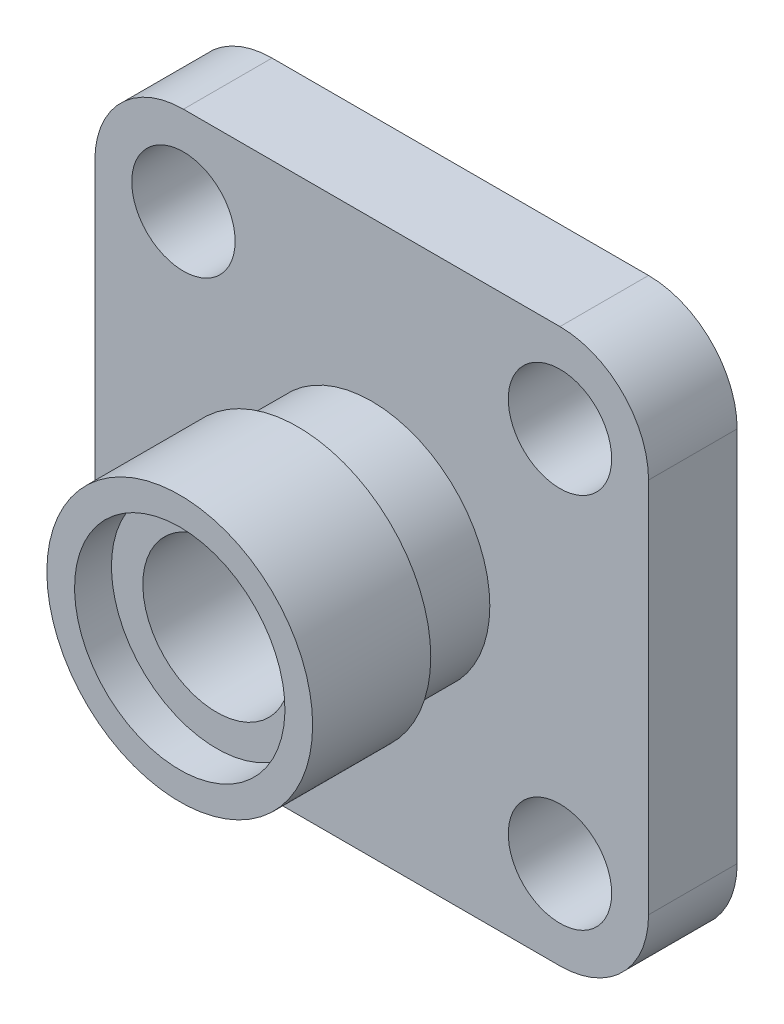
ISO-10303-21;
HEADER;
FILE_DESCRIPTION(('STEP AP214'),'2;1');
FILE_NAME('part.step','',(''),(''),'','','');
FILE_SCHEMA(('AUTOMOTIVE_DESIGN { 1 0 10303 214 1 1 1 1 }'));
ENDSEC;
DATA;
#1=APPLICATION_CONTEXT('core data for automotive mechanical design processes');
#2=APPLICATION_PROTOCOL_DEFINITION('international standard','automotive_design',2000,#1);
#3=PRODUCT_CONTEXT('',#1,'mechanical');
#4=PRODUCT('Part','Part','',(#3));
#5=PRODUCT_RELATED_PRODUCT_CATEGORY('part','',(#4));
#6=PRODUCT_DEFINITION_FORMATION('','',#4);
#7=PRODUCT_DEFINITION_CONTEXT('part definition',#1,'design');
#8=PRODUCT_DEFINITION('design','',#6,#7);
#9=PRODUCT_DEFINITION_SHAPE('','',#8);
#10=(LENGTH_UNIT() NAMED_UNIT(*) SI_UNIT(.MILLI.,.METRE.));
#11=(NAMED_UNIT(*) PLANE_ANGLE_UNIT() SI_UNIT($,.RADIAN.));
#12=(NAMED_UNIT(*) SI_UNIT($,.STERADIAN.) SOLID_ANGLE_UNIT());
#13=UNCERTAINTY_MEASURE_WITH_UNIT(LENGTH_MEASURE(1.E-05),#10,'distance_accuracy_value','');
#14=(GEOMETRIC_REPRESENTATION_CONTEXT(3) GLOBAL_UNCERTAINTY_ASSIGNED_CONTEXT((#13)) GLOBAL_UNIT_ASSIGNED_CONTEXT((#10,
#11,#12)) REPRESENTATION_CONTEXT('',''));
#15=CARTESIAN_POINT('',(0.,0.,0.));
#16=DIRECTION('',(0.,0.,1.));
#17=DIRECTION('',(1.,0.,0.));
#18=AXIS2_PLACEMENT_3D('',#15,#16,#17);
#19=CARTESIAN_POINT('',(0.,0.,48.421885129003));
#20=DIRECTION('',(0.,0.,1.));
#21=DIRECTION('',(1.,0.,0.));
#22=AXIS2_PLACEMENT_3D('',#19,#20,#21);
#23=CYLINDRICAL_SURFACE('',#22,16.);
#24=CARTESIAN_POINT('',(0.,0.,12.));
#25=DIRECTION('',(0.,0.,-1.));
#26=DIRECTION('',(-1.,0.,0.));
#27=AXIS2_PLACEMENT_3D('',#24,#25,#26);
#28=CIRCLE('',#27,16.);
#29=CARTESIAN_POINT('',(-16.,0.,12.));
#30=VERTEX_POINT('',#29);
#31=EDGE_CURVE('E46',#30,#30,#28,.F.);
#32=ORIENTED_EDGE('',*,*,#31,.T.);
#33=EDGE_LOOP('',(#32));
#34=FACE_BOUND('',#33,.T.);
#35=CARTESIAN_POINT('',(0.,0.,22.));
#36=DIRECTION('',(0.,0.,1.));
#37=DIRECTION('',(1.,0.,0.));
#38=AXIS2_PLACEMENT_3D('',#35,#36,#37);
#39=CIRCLE('',#38,16.);
#40=CARTESIAN_POINT('',(16.,0.,22.));
#41=VERTEX_POINT('',#40);
#42=EDGE_CURVE('E11',#41,#41,#39,.T.);
#43=ORIENTED_EDGE('',*,*,#42,.F.);
#44=EDGE_LOOP('',(#43));
#45=FACE_BOUND('',#44,.T.);
#46=ADVANCED_FACE('F37',(#34,#45),#23,.T.);
#47=CARTESIAN_POINT('',(25.5,25.5,12.));
#48=DIRECTION('',(0.,0.,-1.));
#49=DIRECTION('',(-1.,0.,0.));
#50=AXIS2_PLACEMENT_3D('',#47,#48,#49);
#51=PLANE('',#50);
#52=ORIENTED_EDGE('',*,*,#31,.F.);
#53=EDGE_LOOP('',(#52));
#54=FACE_BOUND('',#53,.T.);
#55=CARTESIAN_POINT('',(25.5,25.5,12.));
#56=DIRECTION('',(0.,0.,1.));
#57=DIRECTION('',(-1.,0.,0.));
#58=AXIS2_PLACEMENT_3D('',#55,#56,#57);
#59=CIRCLE('',#58,12.);
#60=CARTESIAN_POINT('',(37.5,25.4999999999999,12.));
#61=VERTEX_POINT('',#60);
#62=CARTESIAN_POINT('',(25.4999999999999,37.5,12.));
#63=VERTEX_POINT('',#62);
#64=EDGE_CURVE('E151',#61,#63,#59,.T.);
#65=ORIENTED_EDGE('',*,*,#64,.T.);
#66=DIRECTION('',(-1.,0.,0.));
#67=VECTOR('',#66,1.);
#68=CARTESIAN_POINT('',(25.4999999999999,37.5,12.));
#69=LINE('',#68,#67);
#70=CARTESIAN_POINT('',(-25.4999999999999,37.5,12.));
#71=VERTEX_POINT('',#70);
#72=EDGE_CURVE('E98',#63,#71,#69,.T.);
#73=ORIENTED_EDGE('',*,*,#72,.T.);
#74=CARTESIAN_POINT('',(-25.5,25.5,12.));
#75=DIRECTION('',(0.,0.,1.));
#76=DIRECTION('',(-1.,0.,0.));
#77=AXIS2_PLACEMENT_3D('',#74,#75,#76);
#78=CIRCLE('',#77,12.);
#79=CARTESIAN_POINT('',(-37.5,25.4999999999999,12.));
#80=VERTEX_POINT('',#79);
#81=EDGE_CURVE('E214',#71,#80,#78,.T.);
#82=ORIENTED_EDGE('',*,*,#81,.T.);
#83=DIRECTION('',(0.,-1.,0.));
#84=VECTOR('',#83,1.);
#85=CARTESIAN_POINT('',(-37.5,-25.4999999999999,12.));
#86=LINE('',#85,#84);
#87=CARTESIAN_POINT('',(-37.5,-25.4999999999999,12.));
#88=VERTEX_POINT('',#87);
#89=EDGE_CURVE('E220',#80,#88,#86,.T.);
#90=ORIENTED_EDGE('',*,*,#89,.T.);
#91=CARTESIAN_POINT('',(-25.5,-25.5,12.));
#92=DIRECTION('',(0.,0.,1.));
#93=DIRECTION('',(-1.,0.,0.));
#94=AXIS2_PLACEMENT_3D('',#91,#92,#93);
#95=CIRCLE('',#94,12.);
#96=CARTESIAN_POINT('',(-25.4999999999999,-37.5,12.));
#97=VERTEX_POINT('',#96);
#98=EDGE_CURVE('E118',#88,#97,#95,.T.);
#99=ORIENTED_EDGE('',*,*,#98,.T.);
#100=DIRECTION('',(1.,0.,0.));
#101=VECTOR('',#100,1.);
#102=CARTESIAN_POINT('',(25.4999999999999,-37.5,12.));
#103=LINE('',#102,#101);
#104=CARTESIAN_POINT('',(25.4999999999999,-37.5,12.));
#105=VERTEX_POINT('',#104);
#106=EDGE_CURVE('E111',#97,#105,#103,.T.);
#107=ORIENTED_EDGE('',*,*,#106,.T.);
#108=CARTESIAN_POINT('',(25.5,-25.5,12.));
#109=DIRECTION('',(0.,0.,1.));
#110=DIRECTION('',(-1.,0.,0.));
#111=AXIS2_PLACEMENT_3D('',#108,#109,#110);
#112=CIRCLE('',#111,12.);
#113=CARTESIAN_POINT('',(37.5,-25.4999999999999,12.));
#114=VERTEX_POINT('',#113);
#115=EDGE_CURVE('E116',#105,#114,#112,.T.);
#116=ORIENTED_EDGE('',*,*,#115,.T.);
#117=DIRECTION('',(0.,1.,0.));
#118=VECTOR('',#117,1.);
#119=CARTESIAN_POINT('',(37.5,-25.4999999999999,12.));
#120=LINE('',#119,#118);
#121=EDGE_CURVE('E54',#114,#61,#120,.T.);
#122=ORIENTED_EDGE('',*,*,#121,.T.);
#123=EDGE_LOOP('',(#65,#73,#82,#90,#99,#107,#116,#122));
#124=FACE_BOUND('',#123,.T.);
#125=CARTESIAN_POINT('',(-25.5,25.5,12.));
#126=DIRECTION('',(0.,0.,1.));
#127=DIRECTION('',(1.,0.,0.));
#128=AXIS2_PLACEMENT_3D('',#125,#126,#127);
#129=CIRCLE('',#128,7.);
#130=CARTESIAN_POINT('',(-18.5,25.5,12.));
#131=VERTEX_POINT('',#130);
#132=EDGE_CURVE('E140',#131,#131,#129,.T.);
#133=ORIENTED_EDGE('',*,*,#132,.F.);
#134=EDGE_LOOP('',(#133));
#135=FACE_BOUND('',#134,.T.);
#136=CARTESIAN_POINT('',(25.5,25.5,12.));
#137=DIRECTION('',(0.,0.,1.));
#138=DIRECTION('',(1.,0.,0.));
#139=AXIS2_PLACEMENT_3D('',#136,#137,#138);
#140=CIRCLE('',#139,7.);
#141=CARTESIAN_POINT('',(32.5,25.5,12.));
#142=VERTEX_POINT('',#141);
#143=EDGE_CURVE('E229',#142,#142,#140,.T.);
#144=ORIENTED_EDGE('',*,*,#143,.F.);
#145=EDGE_LOOP('',(#144));
#146=FACE_BOUND('',#145,.T.);
#147=CARTESIAN_POINT('',(25.5,-25.5,12.));
#148=DIRECTION('',(0.,0.,1.));
#149=DIRECTION('',(1.,0.,0.));
#150=AXIS2_PLACEMENT_3D('',#147,#148,#149);
#151=CIRCLE('',#150,7.);
#152=CARTESIAN_POINT('',(32.5,-25.5,12.));
#153=VERTEX_POINT('',#152);
#154=EDGE_CURVE('E235',#153,#153,#151,.T.);
#155=ORIENTED_EDGE('',*,*,#154,.F.);
#156=EDGE_LOOP('',(#155));
#157=FACE_BOUND('',#156,.T.);
#158=CARTESIAN_POINT('',(-25.5,-25.5,12.));
#159=DIRECTION('',(0.,0.,1.));
#160=DIRECTION('',(1.,0.,0.));
#161=AXIS2_PLACEMENT_3D('',#158,#159,#160);
#162=CIRCLE('',#161,7.);
#163=CARTESIAN_POINT('',(-18.5,-25.5,12.));
#164=VERTEX_POINT('',#163);
#165=EDGE_CURVE('E241',#164,#164,#162,.T.);
#166=ORIENTED_EDGE('',*,*,#165,.F.);
#167=EDGE_LOOP('',(#166));
#168=FACE_BOUND('',#167,.T.);
#169=ADVANCED_FACE('F113',(#54,#124,#135,#146,#157,#168),#51,.F.);
#170=CARTESIAN_POINT('',(25.5,25.5,0.));
#171=DIRECTION('',(0.,0.,-1.));
#172=DIRECTION('',(-1.,0.,0.));
#173=AXIS2_PLACEMENT_3D('',#170,#171,#172);
#174=PLANE('',#173);
#175=CARTESIAN_POINT('',(0.,0.,0.));
#176=DIRECTION('',(0.,0.,1.));
#177=DIRECTION('',(1.,0.,0.));
#178=AXIS2_PLACEMENT_3D('',#175,#176,#177);
#179=CIRCLE('',#178,26.5);
#180=CARTESIAN_POINT('',(26.5,0.,0.));
#181=VERTEX_POINT('',#180);
#182=EDGE_CURVE('E264',#181,#181,#179,.T.);
#183=ORIENTED_EDGE('',*,*,#182,.T.);
#184=EDGE_LOOP('',(#183));
#185=FACE_BOUND('',#184,.T.);
#186=CARTESIAN_POINT('',(25.5,-25.5,0.));
#187=DIRECTION('',(0.,0.,1.));
#188=DIRECTION('',(1.,0.,0.));
#189=AXIS2_PLACEMENT_3D('',#186,#187,#188);
#190=CIRCLE('',#189,7.);
#191=CARTESIAN_POINT('',(32.5,-25.5,0.));
#192=VERTEX_POINT('',#191);
#193=EDGE_CURVE('E238',#192,#192,#190,.T.);
#194=ORIENTED_EDGE('',*,*,#193,.T.);
#195=EDGE_LOOP('',(#194));
#196=FACE_BOUND('',#195,.T.);
#197=CARTESIAN_POINT('',(-25.5,25.5,0.));
#198=DIRECTION('',(0.,0.,1.));
#199=DIRECTION('',(1.,0.,0.));
#200=AXIS2_PLACEMENT_3D('',#197,#198,#199);
#201=CIRCLE('',#200,7.);
#202=CARTESIAN_POINT('',(-18.5,25.5,0.));
#203=VERTEX_POINT('',#202);
#204=EDGE_CURVE('E226',#203,#203,#201,.T.);
#205=ORIENTED_EDGE('',*,*,#204,.T.);
#206=EDGE_LOOP('',(#205));
#207=FACE_BOUND('',#206,.T.);
#208=CARTESIAN_POINT('',(25.5,25.5,0.));
#209=DIRECTION('',(0.,0.,1.));
#210=DIRECTION('',(-1.,0.,0.));
#211=AXIS2_PLACEMENT_3D('',#208,#209,#210);
#212=CIRCLE('',#211,12.);
#213=CARTESIAN_POINT('',(37.5,25.4999999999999,0.));
#214=VERTEX_POINT('',#213);
#215=CARTESIAN_POINT('',(25.4999999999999,37.5,0.));
#216=VERTEX_POINT('',#215);
#217=EDGE_CURVE('E136',#214,#216,#212,.T.);
#218=ORIENTED_EDGE('',*,*,#217,.F.);
#219=DIRECTION('',(0.,1.,0.));
#220=VECTOR('',#219,1.);
#221=CARTESIAN_POINT('',(37.5,-25.4999999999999,0.));
#222=LINE('',#221,#220);
#223=CARTESIAN_POINT('',(37.5,-25.4999999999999,0.));
#224=VERTEX_POINT('',#223);
#225=EDGE_CURVE('E89',#224,#214,#222,.T.);
#226=ORIENTED_EDGE('',*,*,#225,.F.);
#227=CARTESIAN_POINT('',(25.5,-25.5,0.));
#228=DIRECTION('',(0.,0.,1.));
#229=DIRECTION('',(-1.,0.,0.));
#230=AXIS2_PLACEMENT_3D('',#227,#228,#229);
#231=CIRCLE('',#230,12.);
#232=CARTESIAN_POINT('',(25.4999999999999,-37.5,0.));
#233=VERTEX_POINT('',#232);
#234=EDGE_CURVE('E83',#233,#224,#231,.T.);
#235=ORIENTED_EDGE('',*,*,#234,.F.);
#236=DIRECTION('',(1.,0.,0.));
#237=VECTOR('',#236,1.);
#238=CARTESIAN_POINT('',(25.4999999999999,-37.5,0.));
#239=LINE('',#238,#237);
#240=CARTESIAN_POINT('',(-25.4999999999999,-37.5,0.));
#241=VERTEX_POINT('',#240);
#242=EDGE_CURVE('E126',#241,#233,#239,.T.);
#243=ORIENTED_EDGE('',*,*,#242,.F.);
#244=CARTESIAN_POINT('',(-25.5,-25.5,0.));
#245=DIRECTION('',(0.,0.,1.));
#246=DIRECTION('',(-1.,0.,0.));
#247=AXIS2_PLACEMENT_3D('',#244,#245,#246);
#248=CIRCLE('',#247,12.);
#249=CARTESIAN_POINT('',(-37.5,-25.4999999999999,0.));
#250=VERTEX_POINT('',#249);
#251=EDGE_CURVE('E146',#250,#241,#248,.T.);
#252=ORIENTED_EDGE('',*,*,#251,.F.);
#253=DIRECTION('',(0.,-1.,0.));
#254=VECTOR('',#253,1.);
#255=CARTESIAN_POINT('',(-37.5,-25.4999999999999,0.));
#256=LINE('',#255,#254);
#257=CARTESIAN_POINT('',(-37.5,25.4999999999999,0.));
#258=VERTEX_POINT('',#257);
#259=EDGE_CURVE('E144',#258,#250,#256,.T.);
#260=ORIENTED_EDGE('',*,*,#259,.F.);
#261=CARTESIAN_POINT('',(-25.5,25.5,0.));
#262=DIRECTION('',(0.,0.,1.));
#263=DIRECTION('',(-1.,0.,0.));
#264=AXIS2_PLACEMENT_3D('',#261,#262,#263);
#265=CIRCLE('',#264,12.);
#266=CARTESIAN_POINT('',(-25.4999999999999,37.5,0.));
#267=VERTEX_POINT('',#266);
#268=EDGE_CURVE('E142',#267,#258,#265,.T.);
#269=ORIENTED_EDGE('',*,*,#268,.F.);
#270=DIRECTION('',(-1.,0.,0.));
#271=VECTOR('',#270,1.);
#272=CARTESIAN_POINT('',(25.4999999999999,37.5,0.));
#273=LINE('',#272,#271);
#274=EDGE_CURVE('E139',#216,#267,#273,.T.);
#275=ORIENTED_EDGE('',*,*,#274,.F.);
#276=EDGE_LOOP('',(#218,#226,#235,#243,#252,#260,#269,#275));
#277=FACE_BOUND('',#276,.T.);
#278=CARTESIAN_POINT('',(25.5,25.5,0.));
#279=DIRECTION('',(0.,0.,1.));
#280=DIRECTION('',(1.,0.,0.));
#281=AXIS2_PLACEMENT_3D('',#278,#279,#280);
#282=CIRCLE('',#281,7.);
#283=CARTESIAN_POINT('',(32.5,25.5,0.));
#284=VERTEX_POINT('',#283);
#285=EDGE_CURVE('E232',#284,#284,#282,.T.);
#286=ORIENTED_EDGE('',*,*,#285,.T.);
#287=EDGE_LOOP('',(#286));
#288=FACE_BOUND('',#287,.T.);
#289=CARTESIAN_POINT('',(-25.5,-25.5,0.));
#290=DIRECTION('',(0.,0.,1.));
#291=DIRECTION('',(1.,0.,0.));
#292=AXIS2_PLACEMENT_3D('',#289,#290,#291);
#293=CIRCLE('',#292,7.);
#294=CARTESIAN_POINT('',(-18.5,-25.5,0.));
#295=VERTEX_POINT('',#294);
#296=EDGE_CURVE('E244',#295,#295,#293,.T.);
#297=ORIENTED_EDGE('',*,*,#296,.T.);
#298=EDGE_LOOP('',(#297));
#299=FACE_BOUND('',#298,.T.);
#300=ADVANCED_FACE('F171',(#185,#196,#207,#277,#288,#299),#174,.T.);
#301=CARTESIAN_POINT('',(25.5,25.5,12.));
#302=DIRECTION('',(0.,0.,-1.));
#303=DIRECTION('',(-1.,0.,0.));
#304=AXIS2_PLACEMENT_3D('',#301,#302,#303);
#305=CYLINDRICAL_SURFACE('',#304,12.);
#306=ORIENTED_EDGE('',*,*,#217,.T.);
#307=DIRECTION('',(0.,0.,-1.));
#308=VECTOR('',#307,1.);
#309=CARTESIAN_POINT('',(25.4999999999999,37.5,12.));
#310=LINE('',#309,#308);
#311=EDGE_CURVE('E164',#63,#216,#310,.T.);
#312=ORIENTED_EDGE('',*,*,#311,.F.);
#313=ORIENTED_EDGE('',*,*,#64,.F.);
#314=DIRECTION('',(0.,0.,-1.));
#315=VECTOR('',#314,1.);
#316=CARTESIAN_POINT('',(37.5,25.4999999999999,12.));
#317=LINE('',#316,#315);
#318=EDGE_CURVE('E132',#61,#214,#317,.T.);
#319=ORIENTED_EDGE('',*,*,#318,.T.);
#320=EDGE_LOOP('',(#306,#312,#313,#319));
#321=FACE_BOUND('',#320,.T.);
#322=ADVANCED_FACE('F39',(#321),#305,.T.);
#323=CARTESIAN_POINT('',(25.4999999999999,37.5,12.));
#324=DIRECTION('',(0.,-1.,0.));
#325=DIRECTION('',(0.,0.,-1.));
#326=AXIS2_PLACEMENT_3D('',#323,#324,#325);
#327=PLANE('',#326);
#328=ORIENTED_EDGE('',*,*,#274,.T.);
#329=DIRECTION('',(0.,0.,-1.));
#330=VECTOR('',#329,1.);
#331=CARTESIAN_POINT('',(-25.4999999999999,37.5,12.));
#332=LINE('',#331,#330);
#333=EDGE_CURVE('E161',#71,#267,#332,.T.);
#334=ORIENTED_EDGE('',*,*,#333,.F.);
#335=ORIENTED_EDGE('',*,*,#72,.F.);
#336=ORIENTED_EDGE('',*,*,#311,.T.);
#337=EDGE_LOOP('',(#328,#334,#335,#336));
#338=FACE_BOUND('',#337,.T.);
#339=ADVANCED_FACE('F201',(#338),#327,.F.);
#340=CARTESIAN_POINT('',(-25.5,25.5,12.));
#341=DIRECTION('',(0.,0.,-1.));
#342=DIRECTION('',(-1.,0.,0.));
#343=AXIS2_PLACEMENT_3D('',#340,#341,#342);
#344=CYLINDRICAL_SURFACE('',#343,12.);
#345=ORIENTED_EDGE('',*,*,#268,.T.);
#346=DIRECTION('',(0.,0.,-1.));
#347=VECTOR('',#346,1.);
#348=CARTESIAN_POINT('',(-37.5,25.4999999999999,12.));
#349=LINE('',#348,#347);
#350=EDGE_CURVE('E158',#80,#258,#349,.T.);
#351=ORIENTED_EDGE('',*,*,#350,.F.);
#352=ORIENTED_EDGE('',*,*,#81,.F.);
#353=ORIENTED_EDGE('',*,*,#333,.T.);
#354=EDGE_LOOP('',(#345,#351,#352,#353));
#355=FACE_BOUND('',#354,.T.);
#356=ADVANCED_FACE('F198',(#355),#344,.T.);
#357=CARTESIAN_POINT('',(-37.5,-25.4999999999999,12.));
#358=DIRECTION('',(1.,0.,0.));
#359=DIRECTION('',(0.,0.,-1.));
#360=AXIS2_PLACEMENT_3D('',#357,#358,#359);
#361=PLANE('',#360);
#362=ORIENTED_EDGE('',*,*,#259,.T.);
#363=DIRECTION('',(0.,0.,-1.));
#364=VECTOR('',#363,1.);
#365=CARTESIAN_POINT('',(-37.5,-25.4999999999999,12.));
#366=LINE('',#365,#364);
#367=EDGE_CURVE('E155',#88,#250,#366,.T.);
#368=ORIENTED_EDGE('',*,*,#367,.F.);
#369=ORIENTED_EDGE('',*,*,#89,.F.);
#370=ORIENTED_EDGE('',*,*,#350,.T.);
#371=EDGE_LOOP('',(#362,#368,#369,#370));
#372=FACE_BOUND('',#371,.T.);
#373=ADVANCED_FACE('F194',(#372),#361,.F.);
#374=CARTESIAN_POINT('',(-25.5,-25.5,12.));
#375=DIRECTION('',(0.,0.,-1.));
#376=DIRECTION('',(-1.,0.,0.));
#377=AXIS2_PLACEMENT_3D('',#374,#375,#376);
#378=CYLINDRICAL_SURFACE('',#377,12.);
#379=ORIENTED_EDGE('',*,*,#251,.T.);
#380=DIRECTION('',(0.,0.,-1.));
#381=VECTOR('',#380,1.);
#382=CARTESIAN_POINT('',(-25.4999999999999,-37.5,12.));
#383=LINE('',#382,#381);
#384=EDGE_CURVE('E127',#97,#241,#383,.T.);
#385=ORIENTED_EDGE('',*,*,#384,.F.);
#386=ORIENTED_EDGE('',*,*,#98,.F.);
#387=ORIENTED_EDGE('',*,*,#367,.T.);
#388=EDGE_LOOP('',(#379,#385,#386,#387));
#389=FACE_BOUND('',#388,.T.);
#390=ADVANCED_FACE('F191',(#389),#378,.T.);
#391=CARTESIAN_POINT('',(25.4999999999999,-37.5,12.));
#392=DIRECTION('',(0.,1.,0.));
#393=DIRECTION('',(-1.,0.,0.));
#394=AXIS2_PLACEMENT_3D('',#391,#392,#393);
#395=PLANE('',#394);
#396=ORIENTED_EDGE('',*,*,#242,.T.);
#397=DIRECTION('',(0.,0.,-1.));
#398=VECTOR('',#397,1.);
#399=CARTESIAN_POINT('',(25.4999999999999,-37.5,12.));
#400=LINE('',#399,#398);
#401=EDGE_CURVE('E123',#105,#233,#400,.T.);
#402=ORIENTED_EDGE('',*,*,#401,.F.);
#403=ORIENTED_EDGE('',*,*,#106,.F.);
#404=ORIENTED_EDGE('',*,*,#384,.T.);
#405=EDGE_LOOP('',(#396,#402,#403,#404));
#406=FACE_BOUND('',#405,.T.);
#407=ADVANCED_FACE('F124',(#406),#395,.F.);
#408=CARTESIAN_POINT('',(25.5,-25.5,12.));
#409=DIRECTION('',(0.,0.,-1.));
#410=DIRECTION('',(-1.,0.,0.));
#411=AXIS2_PLACEMENT_3D('',#408,#409,#410);
#412=CYLINDRICAL_SURFACE('',#411,12.);
#413=ORIENTED_EDGE('',*,*,#234,.T.);
#414=DIRECTION('',(0.,0.,-1.));
#415=VECTOR('',#414,1.);
#416=CARTESIAN_POINT('',(37.5,-25.4999999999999,12.));
#417=LINE('',#416,#415);
#418=EDGE_CURVE('E128',#114,#224,#417,.T.);
#419=ORIENTED_EDGE('',*,*,#418,.F.);
#420=ORIENTED_EDGE('',*,*,#115,.F.);
#421=ORIENTED_EDGE('',*,*,#401,.T.);
#422=EDGE_LOOP('',(#413,#419,#420,#421));
#423=FACE_BOUND('',#422,.T.);
#424=ADVANCED_FACE('F130',(#423),#412,.T.);
#425=CARTESIAN_POINT('',(37.5,-25.4999999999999,12.));
#426=DIRECTION('',(-1.,0.,0.));
#427=DIRECTION('',(0.,0.,1.));
#428=AXIS2_PLACEMENT_3D('',#425,#426,#427);
#429=PLANE('',#428);
#430=ORIENTED_EDGE('',*,*,#225,.T.);
#431=ORIENTED_EDGE('',*,*,#318,.F.);
#432=ORIENTED_EDGE('',*,*,#121,.F.);
#433=ORIENTED_EDGE('',*,*,#418,.T.);
#434=EDGE_LOOP('',(#430,#431,#432,#433));
#435=FACE_BOUND('',#434,.T.);
#436=ADVANCED_FACE('F184',(#435),#429,.F.);
#437=CARTESIAN_POINT('',(-25.5,25.5,12.));
#438=DIRECTION('',(0.,0.,-1.));
#439=DIRECTION('',(-1.,0.,0.));
#440=AXIS2_PLACEMENT_3D('',#437,#438,#439);
#441=CYLINDRICAL_SURFACE('',#440,7.);
#442=ORIENTED_EDGE('',*,*,#132,.T.);
#443=EDGE_LOOP('',(#442));
#444=FACE_BOUND('',#443,.T.);
#445=ORIENTED_EDGE('',*,*,#204,.F.);
#446=EDGE_LOOP('',(#445));
#447=FACE_BOUND('',#446,.T.);
#448=ADVANCED_FACE('F181',(#444,#447),#441,.F.);
#449=CARTESIAN_POINT('',(25.5,25.5,12.));
#450=DIRECTION('',(0.,0.,-1.));
#451=DIRECTION('',(-1.,0.,0.));
#452=AXIS2_PLACEMENT_3D('',#449,#450,#451);
#453=CYLINDRICAL_SURFACE('',#452,7.);
#454=ORIENTED_EDGE('',*,*,#143,.T.);
#455=EDGE_LOOP('',(#454));
#456=FACE_BOUND('',#455,.T.);
#457=ORIENTED_EDGE('',*,*,#285,.F.);
#458=EDGE_LOOP('',(#457));
#459=FACE_BOUND('',#458,.T.);
#460=ADVANCED_FACE('F358',(#456,#459),#453,.F.);
#461=CARTESIAN_POINT('',(25.5,-25.5,12.));
#462=DIRECTION('',(0.,0.,-1.));
#463=DIRECTION('',(-1.,0.,0.));
#464=AXIS2_PLACEMENT_3D('',#461,#462,#463);
#465=CYLINDRICAL_SURFACE('',#464,7.);
#466=ORIENTED_EDGE('',*,*,#154,.T.);
#467=EDGE_LOOP('',(#466));
#468=FACE_BOUND('',#467,.T.);
#469=ORIENTED_EDGE('',*,*,#193,.F.);
#470=EDGE_LOOP('',(#469));
#471=FACE_BOUND('',#470,.T.);
#472=ADVANCED_FACE('F355',(#468,#471),#465,.F.);
#473=CARTESIAN_POINT('',(-25.5,-25.5,12.));
#474=DIRECTION('',(0.,0.,-1.));
#475=DIRECTION('',(-1.,0.,0.));
#476=AXIS2_PLACEMENT_3D('',#473,#474,#475);
#477=CYLINDRICAL_SURFACE('',#476,7.);
#478=ORIENTED_EDGE('',*,*,#165,.T.);
#479=EDGE_LOOP('',(#478));
#480=FACE_BOUND('',#479,.T.);
#481=ORIENTED_EDGE('',*,*,#296,.F.);
#482=EDGE_LOOP('',(#481));
#483=FACE_BOUND('',#482,.T.);
#484=ADVANCED_FACE('F329',(#480,#483),#477,.F.);
#485=CARTESIAN_POINT('',(0.,0.,48.421885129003));
#486=DIRECTION('',(0.,0.,1.));
#487=DIRECTION('',(1.,0.,0.));
#488=AXIS2_PLACEMENT_3D('',#485,#486,#487);
#489=CYLINDRICAL_SURFACE('',#488,26.5);
#490=ORIENTED_EDGE('',*,*,#182,.F.);
#491=EDGE_LOOP('',(#490));
#492=FACE_BOUND('',#491,.T.);
#493=CARTESIAN_POINT('',(0.,0.,-1.));
#494=DIRECTION('',(0.,0.,1.));
#495=DIRECTION('',(1.,0.,0.));
#496=AXIS2_PLACEMENT_3D('',#493,#494,#495);
#497=CIRCLE('',#496,26.5);
#498=CARTESIAN_POINT('',(26.5,0.,-1.));
#499=VERTEX_POINT('',#498);
#500=EDGE_CURVE('E261',#499,#499,#497,.T.);
#501=ORIENTED_EDGE('',*,*,#500,.T.);
#502=EDGE_LOOP('',(#501));
#503=FACE_BOUND('',#502,.T.);
#504=ADVANCED_FACE('F325',(#492,#503),#489,.T.);
#505=CARTESIAN_POINT('',(0.,26.5,-1.));
#506=DIRECTION('',(0.,0.,1.));
#507=DIRECTION('',(1.,0.,0.));
#508=AXIS2_PLACEMENT_3D('',#505,#506,#507);
#509=PLANE('',#508);
#510=ORIENTED_EDGE('',*,*,#500,.F.);
#511=EDGE_LOOP('',(#510));
#512=FACE_BOUND('',#511,.T.);
#513=CARTESIAN_POINT('',(0.,0.,-1.));
#514=DIRECTION('',(0.,0.,1.));
#515=DIRECTION('',(1.,0.,0.));
#516=AXIS2_PLACEMENT_3D('',#513,#514,#515);
#517=CIRCLE('',#516,25.);
#518=CARTESIAN_POINT('',(25.,0.,-1.));
#519=VERTEX_POINT('',#518);
#520=EDGE_CURVE('E258',#519,#519,#517,.T.);
#521=ORIENTED_EDGE('',*,*,#520,.T.);
#522=EDGE_LOOP('',(#521));
#523=FACE_BOUND('',#522,.T.);
#524=ADVANCED_FACE('F328',(#512,#523),#509,.F.);
#525=CARTESIAN_POINT('',(0.,0.,48.421885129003));
#526=DIRECTION('',(0.,0.,1.));
#527=DIRECTION('',(1.,0.,0.));
#528=AXIS2_PLACEMENT_3D('',#525,#526,#527);
#529=CYLINDRICAL_SURFACE('',#528,25.);
#530=ORIENTED_EDGE('',*,*,#520,.F.);
#531=EDGE_LOOP('',(#530));
#532=FACE_BOUND('',#531,.T.);
#533=CARTESIAN_POINT('',(0.,0.,-6.));
#534=DIRECTION('',(0.,0.,1.));
#535=DIRECTION('',(1.,0.,0.));
#536=AXIS2_PLACEMENT_3D('',#533,#534,#535);
#537=CIRCLE('',#536,25.);
#538=CARTESIAN_POINT('',(25.,0.,-6.));
#539=VERTEX_POINT('',#538);
#540=EDGE_CURVE('E255',#539,#539,#537,.T.);
#541=ORIENTED_EDGE('',*,*,#540,.T.);
#542=EDGE_LOOP('',(#541));
#543=FACE_BOUND('',#542,.T.);
#544=ADVANCED_FACE('F333',(#532,#543),#529,.T.);
#545=CARTESIAN_POINT('',(0.,25.,-6.));
#546=DIRECTION('',(0.,0.,1.));
#547=DIRECTION('',(1.,0.,0.));
#548=AXIS2_PLACEMENT_3D('',#545,#546,#547);
#549=PLANE('',#548);
#550=ORIENTED_EDGE('',*,*,#540,.F.);
#551=EDGE_LOOP('',(#550));
#552=FACE_BOUND('',#551,.T.);
#553=CARTESIAN_POINT('',(0.,0.,-6.));
#554=DIRECTION('',(0.,0.,1.));
#555=DIRECTION('',(1.,0.,0.));
#556=AXIS2_PLACEMENT_3D('',#553,#554,#555);
#557=CIRCLE('',#556,20.5);
#558=CARTESIAN_POINT('',(20.5,0.,-6.));
#559=VERTEX_POINT('',#558);
#560=EDGE_CURVE('E252',#559,#559,#557,.T.);
#561=ORIENTED_EDGE('',*,*,#560,.T.);
#562=EDGE_LOOP('',(#561));
#563=FACE_BOUND('',#562,.T.);
#564=ADVANCED_FACE('F337',(#552,#563),#549,.F.);
#565=CARTESIAN_POINT('',(0.,0.,48.421885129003));
#566=DIRECTION('',(0.,0.,1.));
#567=DIRECTION('',(1.,0.,0.));
#568=AXIS2_PLACEMENT_3D('',#565,#566,#567);
#569=CYLINDRICAL_SURFACE('',#568,20.5);
#570=ORIENTED_EDGE('',*,*,#560,.F.);
#571=EDGE_LOOP('',(#570));
#572=FACE_BOUND('',#571,.T.);
#573=CARTESIAN_POINT('',(0.,0.,-9.99999999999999));
#574=DIRECTION('',(0.,0.,1.));
#575=DIRECTION('',(1.,0.,0.));
#576=AXIS2_PLACEMENT_3D('',#573,#574,#575);
#577=CIRCLE('',#576,20.5);
#578=CARTESIAN_POINT('',(20.5,0.,-9.99999999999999));
#579=VERTEX_POINT('',#578);
#580=EDGE_CURVE('E247',#579,#579,#577,.T.);
#581=ORIENTED_EDGE('',*,*,#580,.T.);
#582=EDGE_LOOP('',(#581));
#583=FACE_BOUND('',#582,.T.);
#584=ADVANCED_FACE('F341',(#572,#583),#569,.T.);
#585=CARTESIAN_POINT('',(0.,20.5,-10.));
#586=DIRECTION('',(0.,0.,1.));
#587=DIRECTION('',(1.,0.,0.));
#588=AXIS2_PLACEMENT_3D('',#585,#586,#587);
#589=PLANE('',#588);
#590=CARTESIAN_POINT('',(0.,0.,-10.));
#591=DIRECTION('',(0.,0.,-1.));
#592=DIRECTION('',(0.,1.,0.));
#593=AXIS2_PLACEMENT_3D('',#590,#591,#592);
#594=CIRCLE('',#593,17.5);
#595=CARTESIAN_POINT('',(0.,17.5,-9.99999999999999));
#596=VERTEX_POINT('',#595);
#597=EDGE_CURVE('E267',#596,#596,#594,.T.);
#598=ORIENTED_EDGE('',*,*,#597,.F.);
#599=EDGE_LOOP('',(#598));
#600=FACE_BOUND('',#599,.T.);
#601=ORIENTED_EDGE('',*,*,#580,.F.);
#602=EDGE_LOOP('',(#601));
#603=FACE_BOUND('',#602,.T.);
#604=ADVANCED_FACE('F345',(#600,#603),#589,.F.);
#605=CARTESIAN_POINT('',(0.,16.,38.));
#606=DIRECTION('',(0.,0.,-1.));
#607=DIRECTION('',(-1.,0.,0.));
#608=AXIS2_PLACEMENT_3D('',#605,#606,#607);
#609=PLANE('',#608);
#610=CARTESIAN_POINT('',(0.,0.,38.));
#611=DIRECTION('',(0.,0.,-1.));
#612=DIRECTION('',(0.,1.,0.));
#613=AXIS2_PLACEMENT_3D('',#610,#611,#612);
#614=CIRCLE('',#613,14.25);
#615=CARTESIAN_POINT('',(0.,14.25,38.));
#616=VERTEX_POINT('',#615);
#617=EDGE_CURVE('E282',#616,#616,#614,.T.);
#618=ORIENTED_EDGE('',*,*,#617,.T.);
#619=EDGE_LOOP('',(#618));
#620=FACE_BOUND('',#619,.T.);
#621=CARTESIAN_POINT('',(0.,0.,38.));
#622=DIRECTION('',(0.,0.,1.));
#623=DIRECTION('',(1.,0.,0.));
#624=AXIS2_PLACEMENT_3D('',#621,#622,#623);
#625=CIRCLE('',#624,18.);
#626=CARTESIAN_POINT('',(18.,0.,38.));
#627=VERTEX_POINT('',#626);
#628=EDGE_CURVE('E286',#627,#627,#625,.T.);
#629=ORIENTED_EDGE('',*,*,#628,.T.);
#630=EDGE_LOOP('',(#629));
#631=FACE_BOUND('',#630,.T.);
#632=ADVANCED_FACE('F323',(#620,#631),#609,.F.);
#633=CARTESIAN_POINT('',(0.,0.,-9.99999999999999));
#634=DIRECTION('',(0.,0.,-1.));
#635=DIRECTION('',(0.,1.,0.));
#636=AXIS2_PLACEMENT_3D('',#633,#634,#635);
#637=CYLINDRICAL_SURFACE('',#636,17.5);
#638=CARTESIAN_POINT('',(0.,0.,-3.));
#639=DIRECTION('',(0.,0.,-1.));
#640=DIRECTION('',(0.,1.,0.));
#641=AXIS2_PLACEMENT_3D('',#638,#639,#640);
#642=CIRCLE('',#641,17.5);
#643=CARTESIAN_POINT('',(0.,17.5,-2.99999999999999));
#644=VERTEX_POINT('',#643);
#645=EDGE_CURVE('E270',#644,#644,#642,.T.);
#646=ORIENTED_EDGE('',*,*,#645,.F.);
#647=EDGE_LOOP('',(#646));
#648=FACE_BOUND('',#647,.T.);
#649=ORIENTED_EDGE('',*,*,#597,.T.);
#650=EDGE_LOOP('',(#649));
#651=FACE_BOUND('',#650,.T.);
#652=ADVANCED_FACE('F319',(#648,#651),#637,.F.);
#653=CARTESIAN_POINT('',(0.,10.,-3.));
#654=DIRECTION('',(0.,0.,1.));
#655=DIRECTION('',(0.,-1.,0.));
#656=AXIS2_PLACEMENT_3D('',#653,#654,#655);
#657=PLANE('',#656);
#658=CARTESIAN_POINT('',(0.,0.,-3.));
#659=DIRECTION('',(0.,0.,-1.));
#660=DIRECTION('',(0.,1.,0.));
#661=AXIS2_PLACEMENT_3D('',#658,#659,#660);
#662=CIRCLE('',#661,10.);
#663=CARTESIAN_POINT('',(0.,10.,-2.99999999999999));
#664=VERTEX_POINT('',#663);
#665=EDGE_CURVE('E273',#664,#664,#662,.T.);
#666=ORIENTED_EDGE('',*,*,#665,.F.);
#667=EDGE_LOOP('',(#666));
#668=FACE_BOUND('',#667,.T.);
#669=ORIENTED_EDGE('',*,*,#645,.T.);
#670=EDGE_LOOP('',(#669));
#671=FACE_BOUND('',#670,.T.);
#672=ADVANCED_FACE('F315',(#668,#671),#657,.F.);
#673=CARTESIAN_POINT('',(0.,0.,-9.99999999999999));
#674=DIRECTION('',(0.,0.,-1.));
#675=DIRECTION('',(0.,1.,0.));
#676=AXIS2_PLACEMENT_3D('',#673,#674,#675);
#677=CYLINDRICAL_SURFACE('',#676,10.);
#678=CARTESIAN_POINT('',(0.,0.,33.));
#679=DIRECTION('',(0.,0.,-1.));
#680=DIRECTION('',(0.,1.,0.));
#681=AXIS2_PLACEMENT_3D('',#678,#679,#680);
#682=CIRCLE('',#681,10.);
#683=CARTESIAN_POINT('',(0.,10.,33.));
#684=VERTEX_POINT('',#683);
#685=EDGE_CURVE('E276',#684,#684,#682,.T.);
#686=ORIENTED_EDGE('',*,*,#685,.F.);
#687=EDGE_LOOP('',(#686));
#688=FACE_BOUND('',#687,.T.);
#689=ORIENTED_EDGE('',*,*,#665,.T.);
#690=EDGE_LOOP('',(#689));
#691=FACE_BOUND('',#690,.T.);
#692=ADVANCED_FACE('F311',(#688,#691),#677,.F.);
#693=CARTESIAN_POINT('',(0.,14.25,33.));
#694=DIRECTION('',(0.,0.,-1.));
#695=DIRECTION('',(0.,1.,0.));
#696=AXIS2_PLACEMENT_3D('',#693,#694,#695);
#697=PLANE('',#696);
#698=CARTESIAN_POINT('',(0.,0.,33.));
#699=DIRECTION('',(0.,0.,-1.));
#700=DIRECTION('',(0.,1.,0.));
#701=AXIS2_PLACEMENT_3D('',#698,#699,#700);
#702=CIRCLE('',#701,14.25);
#703=CARTESIAN_POINT('',(0.,14.25,33.));
#704=VERTEX_POINT('',#703);
#705=EDGE_CURVE('E279',#704,#704,#702,.T.);
#706=ORIENTED_EDGE('',*,*,#705,.F.);
#707=EDGE_LOOP('',(#706));
#708=FACE_BOUND('',#707,.T.);
#709=ORIENTED_EDGE('',*,*,#685,.T.);
#710=EDGE_LOOP('',(#709));
#711=FACE_BOUND('',#710,.T.);
#712=ADVANCED_FACE('F307',(#708,#711),#697,.F.);
#713=CARTESIAN_POINT('',(0.,0.,-9.99999999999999));
#714=DIRECTION('',(0.,0.,-1.));
#715=DIRECTION('',(0.,1.,0.));
#716=AXIS2_PLACEMENT_3D('',#713,#714,#715);
#717=CYLINDRICAL_SURFACE('',#716,14.25);
#718=ORIENTED_EDGE('',*,*,#617,.F.);
#719=EDGE_LOOP('',(#718));
#720=FACE_BOUND('',#719,.T.);
#721=ORIENTED_EDGE('',*,*,#705,.T.);
#722=EDGE_LOOP('',(#721));
#723=FACE_BOUND('',#722,.T.);
#724=ADVANCED_FACE('F302',(#720,#723),#717,.F.);
#725=CARTESIAN_POINT('',(0.,0.,22.));
#726=DIRECTION('',(0.,0.,1.));
#727=DIRECTION('',(1.,0.,0.));
#728=AXIS2_PLACEMENT_3D('',#725,#726,#727);
#729=CYLINDRICAL_SURFACE('',#728,18.);
#730=CARTESIAN_POINT('',(0.,0.,22.));
#731=DIRECTION('',(0.,0.,1.));
#732=DIRECTION('',(1.,0.,0.));
#733=AXIS2_PLACEMENT_3D('',#730,#731,#732);
#734=CIRCLE('',#733,18.);
#735=CARTESIAN_POINT('',(18.,0.,22.));
#736=VERTEX_POINT('',#735);
#737=EDGE_CURVE('E285',#736,#736,#734,.T.);
#738=ORIENTED_EDGE('',*,*,#737,.T.);
#739=EDGE_LOOP('',(#738));
#740=FACE_BOUND('',#739,.T.);
#741=ORIENTED_EDGE('',*,*,#628,.F.);
#742=EDGE_LOOP('',(#741));
#743=FACE_BOUND('',#742,.T.);
#744=ADVANCED_FACE('F292',(#740,#743),#729,.T.);
#745=CARTESIAN_POINT('',(0.,0.,22.));
#746=DIRECTION('',(0.,0.,1.));
#747=DIRECTION('',(1.,0.,0.));
#748=AXIS2_PLACEMENT_3D('',#745,#746,#747);
#749=PLANE('',#748);
#750=ORIENTED_EDGE('',*,*,#42,.T.);
#751=EDGE_LOOP('',(#750));
#752=FACE_BOUND('',#751,.T.);
#753=ORIENTED_EDGE('',*,*,#737,.F.);
#754=EDGE_LOOP('',(#753));
#755=FACE_BOUND('',#754,.T.);
#756=ADVANCED_FACE('F295',(#752,#755),#749,.F.);
#757=CLOSED_SHELL('',(#46,#169,#300,#322,#339,#356,#373,#390,#407,#424,#436,#448,#460,#472,#484,
#504,#524,#544,#564,#584,#604,#632,#652,#672,#692,#712,#724,#744,#756));
#758=MANIFOLD_SOLID_BREP('B2',#757);
#759=ADVANCED_BREP_SHAPE_REPRESENTATION('',(#18,#758),#14);
#760=SHAPE_DEFINITION_REPRESENTATION(#9,#759);
ENDSEC;
END-ISO-10303-21;
